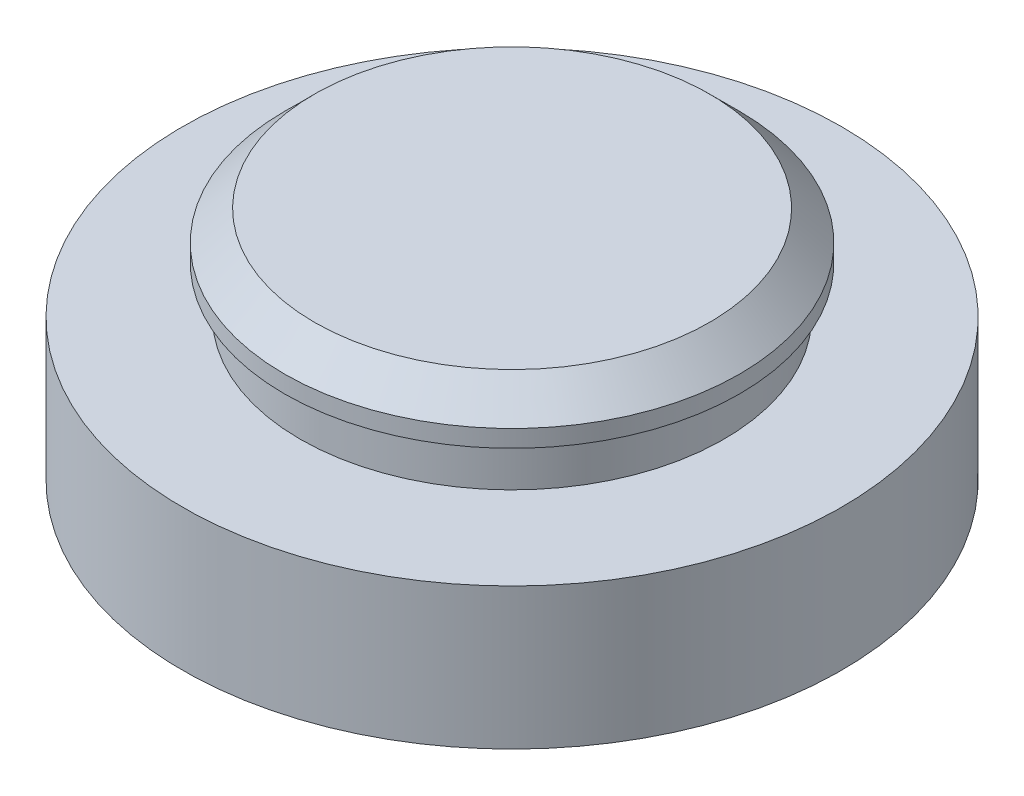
ISO-10303-21;
HEADER;
FILE_DESCRIPTION(('STEP AP214'),'2;1');
FILE_NAME('part.step','',(''),(''),'','','');
FILE_SCHEMA(('AUTOMOTIVE_DESIGN { 1 0 10303 214 1 1 1 1 }'));
ENDSEC;
DATA;
#1=APPLICATION_CONTEXT('core data for automotive mechanical design processes');
#2=APPLICATION_PROTOCOL_DEFINITION('international standard','automotive_design',2000,#1);
#3=PRODUCT_CONTEXT('',#1,'mechanical');
#4=PRODUCT('Part','Part','',(#3));
#5=PRODUCT_RELATED_PRODUCT_CATEGORY('part','',(#4));
#6=PRODUCT_DEFINITION_FORMATION('','',#4);
#7=PRODUCT_DEFINITION_CONTEXT('part definition',#1,'design');
#8=PRODUCT_DEFINITION('design','',#6,#7);
#9=PRODUCT_DEFINITION_SHAPE('','',#8);
#10=(LENGTH_UNIT() NAMED_UNIT(*) SI_UNIT(.MILLI.,.METRE.));
#11=(NAMED_UNIT(*) PLANE_ANGLE_UNIT() SI_UNIT($,.RADIAN.));
#12=(NAMED_UNIT(*) SI_UNIT($,.STERADIAN.) SOLID_ANGLE_UNIT());
#13=UNCERTAINTY_MEASURE_WITH_UNIT(LENGTH_MEASURE(1.E-05),#10,'distance_accuracy_value','');
#14=(GEOMETRIC_REPRESENTATION_CONTEXT(3) GLOBAL_UNCERTAINTY_ASSIGNED_CONTEXT((#13)) GLOBAL_UNIT_ASSIGNED_CONTEXT((#10,
#11,#12)) REPRESENTATION_CONTEXT('',''));
#15=CARTESIAN_POINT('',(0.,0.,0.));
#16=DIRECTION('',(0.,0.,1.));
#17=DIRECTION('',(1.,0.,0.));
#18=AXIS2_PLACEMENT_3D('',#15,#16,#17);
#19=CARTESIAN_POINT('',(0.,3.,0.));
#20=DIRECTION('',(0.,-1.,0.));
#21=DIRECTION('',(0.,0.,-1.));
#22=AXIS2_PLACEMENT_3D('',#19,#20,#21);
#23=CYLINDRICAL_SURFACE('',#22,13.5);
#24=CARTESIAN_POINT('',(0.,3.,0.));
#25=DIRECTION('',(0.,1.,0.));
#26=DIRECTION('',(0.,0.,1.));
#27=AXIS2_PLACEMENT_3D('',#24,#25,#26);
#28=CIRCLE('',#27,13.5);
#29=CARTESIAN_POINT('',(0.,3.,13.5));
#30=VERTEX_POINT('',#29);
#31=EDGE_CURVE('E54',#30,#30,#28,.T.);
#32=ORIENTED_EDGE('',*,*,#31,.F.);
#33=EDGE_LOOP('',(#32));
#34=FACE_BOUND('',#33,.T.);
#35=CARTESIAN_POINT('',(0.,0.,0.));
#36=DIRECTION('',(0.,1.,0.));
#37=DIRECTION('',(0.,0.,1.));
#38=AXIS2_PLACEMENT_3D('',#35,#36,#37);
#39=CIRCLE('',#38,13.5);
#40=CARTESIAN_POINT('',(0.,0.,13.5));
#41=VERTEX_POINT('',#40);
#42=EDGE_CURVE('E55',#41,#41,#39,.T.);
#43=ORIENTED_EDGE('',*,*,#42,.T.);
#44=EDGE_LOOP('',(#43));
#45=FACE_BOUND('',#44,.T.);
#46=ADVANCED_FACE('F31',(#34,#45),#23,.T.);
#47=CARTESIAN_POINT('',(0.,6.,0.));
#48=DIRECTION('',(0.,-1.,0.));
#49=DIRECTION('',(0.,0.,-1.));
#50=AXIS2_PLACEMENT_3D('',#47,#48,#49);
#51=CYLINDRICAL_SURFACE('',#50,14.5);
#52=CARTESIAN_POINT('',(0.,4.09499999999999,0.));
#53=DIRECTION('',(0.,1.,0.));
#54=DIRECTION('',(0.,0.,1.));
#55=AXIS2_PLACEMENT_3D('',#52,#53,#54);
#56=CIRCLE('',#55,14.5);
#57=CARTESIAN_POINT('',(0.,4.09499999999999,14.5));
#58=VERTEX_POINT('',#57);
#59=EDGE_CURVE('E46',#58,#58,#56,.F.);
#60=ORIENTED_EDGE('',*,*,#59,.T.);
#61=EDGE_LOOP('',(#60));
#62=FACE_BOUND('',#61,.T.);
#63=CARTESIAN_POINT('',(0.,3.,0.));
#64=DIRECTION('',(0.,1.,0.));
#65=DIRECTION('',(0.,0.,1.));
#66=AXIS2_PLACEMENT_3D('',#63,#64,#65);
#67=CIRCLE('',#66,14.5);
#68=CARTESIAN_POINT('',(0.,3.,14.5));
#69=VERTEX_POINT('',#68);
#70=EDGE_CURVE('E58',#69,#69,#67,.T.);
#71=ORIENTED_EDGE('',*,*,#70,.T.);
#72=EDGE_LOOP('',(#71));
#73=FACE_BOUND('',#72,.T.);
#74=ADVANCED_FACE('F94',(#62,#73),#51,.T.);
#75=CARTESIAN_POINT('',(0.,6.,0.));
#76=DIRECTION('',(0.,1.,0.));
#77=DIRECTION('',(0.,0.,1.));
#78=AXIS2_PLACEMENT_3D('',#75,#76,#77);
#79=PLANE('',#78);
#80=CARTESIAN_POINT('',(0.,6.,0.));
#81=DIRECTION('',(0.,1.,0.));
#82=DIRECTION('',(0.,0.,1.));
#83=AXIS2_PLACEMENT_3D('',#80,#81,#82);
#84=CIRCLE('',#83,12.595);
#85=CARTESIAN_POINT('',(0.,6.,12.595));
#86=VERTEX_POINT('',#85);
#87=EDGE_CURVE('E51',#86,#86,#84,.T.);
#88=ORIENTED_EDGE('',*,*,#87,.T.);
#89=EDGE_LOOP('',(#88));
#90=FACE_BOUND('',#89,.T.);
#91=ADVANCED_FACE('F100',(#90),#79,.T.);
#92=CARTESIAN_POINT('',(0.,3.,0.));
#93=DIRECTION('',(0.,1.,0.));
#94=DIRECTION('',(0.,0.,1.));
#95=AXIS2_PLACEMENT_3D('',#92,#93,#94);
#96=PLANE('',#95);
#97=ORIENTED_EDGE('',*,*,#31,.T.);
#98=EDGE_LOOP('',(#97));
#99=FACE_BOUND('',#98,.T.);
#100=ORIENTED_EDGE('',*,*,#70,.F.);
#101=EDGE_LOOP('',(#100));
#102=FACE_BOUND('',#101,.T.);
#103=ADVANCED_FACE('F107',(#99,#102),#96,.F.);
#104=CARTESIAN_POINT('',(0.,6.,0.));
#105=DIRECTION('',(0.,-1.,0.));
#106=DIRECTION('',(0.,0.,-1.));
#107=AXIS2_PLACEMENT_3D('',#104,#105,#106);
#108=CONICAL_SURFACE('',#107,12.595,0.785398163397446);
#109=ORIENTED_EDGE('',*,*,#59,.F.);
#110=EDGE_LOOP('',(#109));
#111=FACE_BOUND('',#110,.T.);
#112=ORIENTED_EDGE('',*,*,#87,.F.);
#113=EDGE_LOOP('',(#112));
#114=FACE_BOUND('',#113,.T.);
#115=ADVANCED_FACE('F75',(#111,#114),#108,.T.);
#116=CARTESIAN_POINT('',(0.,-9.,0.));
#117=DIRECTION('',(0.,1.,0.));
#118=DIRECTION('',(0.,0.,1.));
#119=AXIS2_PLACEMENT_3D('',#116,#117,#118);
#120=CYLINDRICAL_SURFACE('',#119,21.);
#121=CARTESIAN_POINT('',(0.,-9.,0.));
#122=DIRECTION('',(0.,-1.,0.));
#123=DIRECTION('',(0.,0.,-1.));
#124=AXIS2_PLACEMENT_3D('',#121,#122,#123);
#125=CIRCLE('',#124,21.);
#126=CARTESIAN_POINT('',(0.,-9.,-21.));
#127=VERTEX_POINT('',#126);
#128=EDGE_CURVE('E59',#127,#127,#125,.T.);
#129=ORIENTED_EDGE('',*,*,#128,.F.);
#130=EDGE_LOOP('',(#129));
#131=FACE_BOUND('',#130,.T.);
#132=CARTESIAN_POINT('',(0.,0.,0.));
#133=DIRECTION('',(0.,-1.,0.));
#134=DIRECTION('',(0.,0.,-1.));
#135=AXIS2_PLACEMENT_3D('',#132,#133,#134);
#136=CIRCLE('',#135,21.);
#137=CARTESIAN_POINT('',(0.,0.,-21.));
#138=VERTEX_POINT('',#137);
#139=EDGE_CURVE('E64',#138,#138,#136,.T.);
#140=ORIENTED_EDGE('',*,*,#139,.T.);
#141=EDGE_LOOP('',(#140));
#142=FACE_BOUND('',#141,.T.);
#143=ADVANCED_FACE('F72',(#131,#142),#120,.T.);
#144=CARTESIAN_POINT('',(0.,-9.,0.));
#145=DIRECTION('',(0.,-1.,0.));
#146=DIRECTION('',(0.,0.,-1.));
#147=AXIS2_PLACEMENT_3D('',#144,#145,#146);
#148=PLANE('',#147);
#149=CARTESIAN_POINT('',(0.,-9.,0.));
#150=DIRECTION('',(0.,-1.,0.));
#151=DIRECTION('',(0.,0.,-1.));
#152=AXIS2_PLACEMENT_3D('',#149,#150,#151);
#153=CIRCLE('',#152,9.);
#154=CARTESIAN_POINT('',(0.,-9.,-9.));
#155=VERTEX_POINT('',#154);
#156=EDGE_CURVE('E42',#155,#155,#153,.T.);
#157=ORIENTED_EDGE('',*,*,#156,.F.);
#158=EDGE_LOOP('',(#157));
#159=FACE_BOUND('',#158,.T.);
#160=ORIENTED_EDGE('',*,*,#128,.T.);
#161=EDGE_LOOP('',(#160));
#162=FACE_BOUND('',#161,.T.);
#163=ADVANCED_FACE('F70',(#159,#162),#148,.T.);
#164=CARTESIAN_POINT('',(0.,0.,0.));
#165=DIRECTION('',(0.,-1.,0.));
#166=DIRECTION('',(0.,0.,-1.));
#167=AXIS2_PLACEMENT_3D('',#164,#165,#166);
#168=PLANE('',#167);
#169=ORIENTED_EDGE('',*,*,#42,.F.);
#170=EDGE_LOOP('',(#169));
#171=FACE_BOUND('',#170,.T.);
#172=ORIENTED_EDGE('',*,*,#139,.F.);
#173=EDGE_LOOP('',(#172));
#174=FACE_BOUND('',#173,.T.);
#175=ADVANCED_FACE('F79',(#171,#174),#168,.F.);
#176=CARTESIAN_POINT('',(0.,-16.,0.));
#177=DIRECTION('',(0.,1.,0.));
#178=DIRECTION('',(0.,0.,1.));
#179=AXIS2_PLACEMENT_3D('',#176,#177,#178);
#180=CYLINDRICAL_SURFACE('',#179,9.);
#181=CARTESIAN_POINT('',(0.,-9.65,0.));
#182=DIRECTION('',(0.,-1.,0.));
#183=DIRECTION('',(0.,0.,-1.));
#184=AXIS2_PLACEMENT_3D('',#181,#182,#183);
#185=CIRCLE('',#184,9.);
#186=CARTESIAN_POINT('',(0.,-9.65,-9.));
#187=VERTEX_POINT('',#186);
#188=EDGE_CURVE('E10',#187,#187,#185,.F.);
#189=ORIENTED_EDGE('',*,*,#188,.T.);
#190=EDGE_LOOP('',(#189));
#191=FACE_BOUND('',#190,.T.);
#192=ORIENTED_EDGE('',*,*,#156,.T.);
#193=EDGE_LOOP('',(#192));
#194=FACE_BOUND('',#193,.T.);
#195=ADVANCED_FACE('F81',(#191,#194),#180,.T.);
#196=CARTESIAN_POINT('',(0.,-16.,0.));
#197=DIRECTION('',(0.,-1.,0.));
#198=DIRECTION('',(0.,0.,-1.));
#199=AXIS2_PLACEMENT_3D('',#196,#197,#198);
#200=PLANE('',#199);
#201=CARTESIAN_POINT('',(0.,-16.,0.));
#202=DIRECTION('',(0.,-1.,0.));
#203=DIRECTION('',(0.,0.,-1.));
#204=AXIS2_PLACEMENT_3D('',#201,#202,#203);
#205=CIRCLE('',#204,2.65);
#206=CARTESIAN_POINT('',(0.,-16.,-2.65));
#207=VERTEX_POINT('',#206);
#208=EDGE_CURVE('E38',#207,#207,#205,.T.);
#209=ORIENTED_EDGE('',*,*,#208,.T.);
#210=EDGE_LOOP('',(#209));
#211=FACE_BOUND('',#210,.T.);
#212=ADVANCED_FACE('F88',(#211),#200,.T.);
#213=CARTESIAN_POINT('',(0.,-9.65,0.));
#214=DIRECTION('',(0.,-1.,0.));
#215=DIRECTION('',(0.,0.,-1.));
#216=AXIS2_PLACEMENT_3D('',#213,#214,#215);
#217=DEGENERATE_TOROIDAL_SURFACE('',#216,2.65,6.35,.T.);
#218=ORIENTED_EDGE('',*,*,#188,.F.);
#219=EDGE_LOOP('',(#218));
#220=FACE_BOUND('',#219,.T.);
#221=ORIENTED_EDGE('',*,*,#208,.F.);
#222=EDGE_LOOP('',(#221));
#223=FACE_BOUND('',#222,.T.);
#224=ADVANCED_FACE('F33',(#220,#223),#217,.T.);
#225=CLOSED_SHELL('',(#46,#74,#91,#103,#115,#143,#163,#175,#195,#212,#224));
#226=MANIFOLD_SOLID_BREP('B2',#225);
#227=ADVANCED_BREP_SHAPE_REPRESENTATION('',(#18,#226),#14);
#228=SHAPE_DEFINITION_REPRESENTATION(#9,#227);
ENDSEC;
END-ISO-10303-21;
